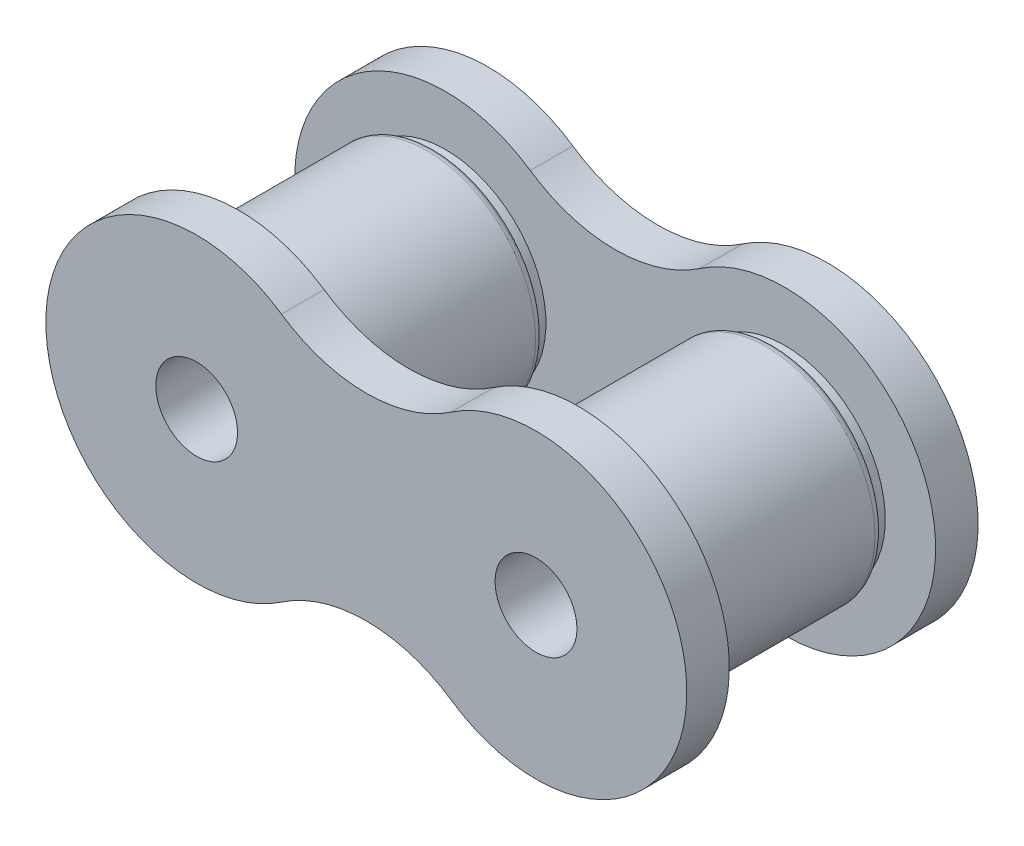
ISO-10303-21;
HEADER;
FILE_DESCRIPTION(('STEP AP214'),'2;1');
FILE_NAME('part.step','',(''),(''),'','','');
FILE_SCHEMA(('AUTOMOTIVE_DESIGN { 1 0 10303 214 1 1 1 1 }'));
ENDSEC;
DATA;
#1=APPLICATION_CONTEXT('core data for automotive mechanical design processes');
#2=APPLICATION_PROTOCOL_DEFINITION('international standard','automotive_design',2000,#1);
#3=PRODUCT_CONTEXT('',#1,'mechanical');
#4=PRODUCT('Part','Part','',(#3));
#5=PRODUCT_RELATED_PRODUCT_CATEGORY('part','',(#4));
#6=PRODUCT_DEFINITION_FORMATION('','',#4);
#7=PRODUCT_DEFINITION_CONTEXT('part definition',#1,'design');
#8=PRODUCT_DEFINITION('design','',#6,#7);
#9=PRODUCT_DEFINITION_SHAPE('','',#8);
#10=(LENGTH_UNIT() NAMED_UNIT(*) SI_UNIT(.MILLI.,.METRE.));
#11=(NAMED_UNIT(*) PLANE_ANGLE_UNIT() SI_UNIT($,.RADIAN.));
#12=(NAMED_UNIT(*) SI_UNIT($,.STERADIAN.) SOLID_ANGLE_UNIT());
#13=UNCERTAINTY_MEASURE_WITH_UNIT(LENGTH_MEASURE(1.E-05),#10,'distance_accuracy_value','');
#14=(GEOMETRIC_REPRESENTATION_CONTEXT(3) GLOBAL_UNCERTAINTY_ASSIGNED_CONTEXT((#13)) GLOBAL_UNIT_ASSIGNED_CONTEXT((#10,
#11,#12)) REPRESENTATION_CONTEXT('',''));
#15=CARTESIAN_POINT('',(0.,0.,0.));
#16=DIRECTION('',(0.,0.,1.));
#17=DIRECTION('',(1.,0.,0.));
#18=AXIS2_PLACEMENT_3D('',#15,#16,#17);
#19=CARTESIAN_POINT('',(0.,0.,-6.815));
#20=DIRECTION('',(0.,0.,-1.));
#21=DIRECTION('',(-1.,0.,0.));
#22=AXIS2_PLACEMENT_3D('',#19,#20,#21);
#23=PLANE('',#22);
#24=CARTESIAN_POINT('',(15.875,0.,-6.815));
#25=DIRECTION('',(0.,0.,-1.));
#26=DIRECTION('',(-1.,0.,0.));
#27=AXIS2_PLACEMENT_3D('',#24,#25,#26);
#28=CIRCLE('',#27,1.915);
#29=CARTESIAN_POINT('',(13.96,0.,-6.815));
#30=VERTEX_POINT('',#29);
#31=EDGE_CURVE('E315',#30,#30,#28,.T.);
#32=ORIENTED_EDGE('',*,*,#31,.F.);
#33=EDGE_LOOP('',(#32));
#34=FACE_BOUND('',#33,.T.);
#35=CARTESIAN_POINT('',(7.9375,-11.666893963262,-6.815));
#36=DIRECTION('',(0.,0.,1.));
#37=DIRECTION('',(1.,0.,0.));
#38=AXIS2_PLACEMENT_3D('',#35,#36,#37);
#39=CIRCLE('',#38,7.0555);
#40=CARTESIAN_POINT('',(11.90625,-5.833446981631,-6.815));
#41=VERTEX_POINT('',#40);
#42=CARTESIAN_POINT('',(3.96875,-5.83344698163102,-6.815));
#43=VERTEX_POINT('',#42);
#44=EDGE_CURVE('E288',#41,#43,#39,.T.);
#45=ORIENTED_EDGE('',*,*,#44,.T.);
#46=CARTESIAN_POINT('',(0.,0.,-6.815));
#47=DIRECTION('',(0.,0.,1.));
#48=DIRECTION('',(1.,0.,0.));
#49=AXIS2_PLACEMENT_3D('',#46,#47,#48);
#50=CIRCLE('',#49,7.0555);
#51=CARTESIAN_POINT('',(3.96874999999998,5.83344698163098,-6.815));
#52=VERTEX_POINT('',#51);
#53=EDGE_CURVE('E43',#43,#52,#50,.F.);
#54=ORIENTED_EDGE('',*,*,#53,.T.);
#55=CARTESIAN_POINT('',(7.9375,11.666893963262,-6.815));
#56=DIRECTION('',(0.,0.,1.));
#57=DIRECTION('',(1.,0.,0.));
#58=AXIS2_PLACEMENT_3D('',#55,#56,#57);
#59=CIRCLE('',#58,7.05550000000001);
#60=CARTESIAN_POINT('',(11.90625,5.83344698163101,-6.815));
#61=VERTEX_POINT('',#60);
#62=EDGE_CURVE('E51',#52,#61,#59,.T.);
#63=ORIENTED_EDGE('',*,*,#62,.T.);
#64=CARTESIAN_POINT('',(15.875,0.,-6.815));
#65=DIRECTION('',(0.,0.,1.));
#66=DIRECTION('',(1.,0.,0.));
#67=AXIS2_PLACEMENT_3D('',#64,#65,#66);
#68=CIRCLE('',#67,7.0555);
#69=EDGE_CURVE('E285',#61,#41,#68,.F.);
#70=ORIENTED_EDGE('',*,*,#69,.T.);
#71=EDGE_LOOP('',(#45,#54,#63,#70));
#72=FACE_BOUND('',#71,.T.);
#73=CARTESIAN_POINT('',(0.,0.,-6.815));
#74=DIRECTION('',(0.,0.,-1.));
#75=DIRECTION('',(-1.,0.,0.));
#76=AXIS2_PLACEMENT_3D('',#73,#74,#75);
#77=CIRCLE('',#76,1.9125);
#78=CARTESIAN_POINT('',(-1.9125,0.,-6.815));
#79=VERTEX_POINT('',#78);
#80=EDGE_CURVE('E11',#79,#79,#77,.F.);
#81=ORIENTED_EDGE('',*,*,#80,.T.);
#82=EDGE_LOOP('',(#81));
#83=FACE_BOUND('',#82,.T.);
#84=ADVANCED_FACE('F33',(#34,#72,#83),#23,.T.);
#85=CARTESIAN_POINT('',(0.,0.,3.943));
#86=DIRECTION('',(0.,0.,1.));
#87=DIRECTION('',(-1.,0.,0.));
#88=AXIS2_PLACEMENT_3D('',#85,#86,#87);
#89=TOROIDAL_SURFACE('',#88,4.7,0.4);
#90=CARTESIAN_POINT('',(0.,0.,4.343));
#91=DIRECTION('',(0.,0.,-1.));
#92=DIRECTION('',(-1.,0.,0.));
#93=AXIS2_PLACEMENT_3D('',#90,#91,#92);
#94=CIRCLE('',#93,4.7);
#95=CARTESIAN_POINT('',(-4.7,0.,4.343));
#96=VERTEX_POINT('',#95);
#97=EDGE_CURVE('E279',#96,#96,#94,.F.);
#98=ORIENTED_EDGE('',*,*,#97,.F.);
#99=EDGE_LOOP('',(#98));
#100=FACE_BOUND('',#99,.T.);
#101=CARTESIAN_POINT('',(0.,0.,3.943));
#102=DIRECTION('',(0.,0.,-1.));
#103=DIRECTION('',(-1.,0.,0.));
#104=AXIS2_PLACEMENT_3D('',#101,#102,#103);
#105=CIRCLE('',#104,5.1);
#106=CARTESIAN_POINT('',(-5.1,0.,3.943));
#107=VERTEX_POINT('',#106);
#108=EDGE_CURVE('E276',#107,#107,#105,.T.);
#109=ORIENTED_EDGE('',*,*,#108,.F.);
#110=EDGE_LOOP('',(#109));
#111=FACE_BOUND('',#110,.T.);
#112=ADVANCED_FACE('F35',(#100,#111),#89,.T.);
#113=CARTESIAN_POINT('',(15.875,0.,3.94299999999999));
#114=DIRECTION('',(0.,0.,1.));
#115=DIRECTION('',(-1.,0.,0.));
#116=AXIS2_PLACEMENT_3D('',#113,#114,#115);
#117=TOROIDAL_SURFACE('',#116,4.7,0.400000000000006);
#118=CARTESIAN_POINT('',(15.875,0.,3.943));
#119=DIRECTION('',(0.,0.,-1.));
#120=DIRECTION('',(-1.,0.,0.));
#121=AXIS2_PLACEMENT_3D('',#118,#119,#120);
#122=CIRCLE('',#121,5.1);
#123=CARTESIAN_POINT('',(10.775,0.,3.943));
#124=VERTEX_POINT('',#123);
#125=EDGE_CURVE('E272',#124,#124,#122,.T.);
#126=ORIENTED_EDGE('',*,*,#125,.F.);
#127=EDGE_LOOP('',(#126));
#128=FACE_BOUND('',#127,.T.);
#129=CARTESIAN_POINT('',(15.875,0.,4.343));
#130=DIRECTION('',(0.,0.,-1.));
#131=DIRECTION('',(-1.,0.,0.));
#132=AXIS2_PLACEMENT_3D('',#129,#130,#131);
#133=CIRCLE('',#132,4.7);
#134=CARTESIAN_POINT('',(11.175,0.,4.343));
#135=VERTEX_POINT('',#134);
#136=EDGE_CURVE('E282',#135,#135,#133,.F.);
#137=ORIENTED_EDGE('',*,*,#136,.F.);
#138=EDGE_LOOP('',(#137));
#139=FACE_BOUND('',#138,.T.);
#140=ADVANCED_FACE('F177',(#128,#139),#117,.T.);
#141=CARTESIAN_POINT('',(15.875,0.,4.584));
#142=DIRECTION('',(0.,0.,-1.));
#143=DIRECTION('',(-1.,0.,0.));
#144=AXIS2_PLACEMENT_3D('',#141,#142,#143);
#145=CYLINDRICAL_SURFACE('',#144,4.7);
#146=CARTESIAN_POINT('',(15.875,0.,4.825));
#147=DIRECTION('',(0.,0.,-1.));
#148=DIRECTION('',(-1.,0.,0.));
#149=AXIS2_PLACEMENT_3D('',#146,#147,#148);
#150=CIRCLE('',#149,4.7);
#151=CARTESIAN_POINT('',(11.175,0.,4.825));
#152=VERTEX_POINT('',#151);
#153=EDGE_CURVE('E116',#152,#152,#150,.F.);
#154=ORIENTED_EDGE('',*,*,#153,.F.);
#155=EDGE_LOOP('',(#154));
#156=FACE_BOUND('',#155,.T.);
#157=ORIENTED_EDGE('',*,*,#136,.T.);
#158=EDGE_LOOP('',(#157));
#159=FACE_BOUND('',#158,.T.);
#160=ADVANCED_FACE('F174',(#156,#159),#145,.T.);
#161=CARTESIAN_POINT('',(0.,0.,4.584));
#162=DIRECTION('',(0.,0.,-1.));
#163=DIRECTION('',(-1.,0.,0.));
#164=AXIS2_PLACEMENT_3D('',#161,#162,#163);
#165=CYLINDRICAL_SURFACE('',#164,4.7);
#166=CARTESIAN_POINT('',(0.,0.,4.825));
#167=DIRECTION('',(0.,0.,-1.));
#168=DIRECTION('',(-1.,0.,0.));
#169=AXIS2_PLACEMENT_3D('',#166,#167,#168);
#170=CIRCLE('',#169,4.7);
#171=CARTESIAN_POINT('',(-4.7,0.,4.825));
#172=VERTEX_POINT('',#171);
#173=EDGE_CURVE('E275',#172,#172,#170,.F.);
#174=ORIENTED_EDGE('',*,*,#173,.F.);
#175=EDGE_LOOP('',(#174));
#176=FACE_BOUND('',#175,.T.);
#177=ORIENTED_EDGE('',*,*,#97,.T.);
#178=EDGE_LOOP('',(#177));
#179=FACE_BOUND('',#178,.T.);
#180=ADVANCED_FACE('F170',(#176,#179),#165,.T.);
#181=CARTESIAN_POINT('',(0.,0.,0.));
#182=DIRECTION('',(0.,0.,-1.));
#183=DIRECTION('',(-1.,0.,0.));
#184=AXIS2_PLACEMENT_3D('',#181,#182,#183);
#185=CYLINDRICAL_SURFACE('',#184,5.1);
#186=CARTESIAN_POINT('',(0.,0.,-3.943));
#187=DIRECTION('',(0.,0.,1.));
#188=DIRECTION('',(-1.,0.,0.));
#189=AXIS2_PLACEMENT_3D('',#186,#187,#188);
#190=CIRCLE('',#189,5.1);
#191=CARTESIAN_POINT('',(-5.1,0.,-3.943));
#192=VERTEX_POINT('',#191);
#193=EDGE_CURVE('E269',#192,#192,#190,.F.);
#194=ORIENTED_EDGE('',*,*,#193,.F.);
#195=EDGE_LOOP('',(#194));
#196=FACE_BOUND('',#195,.T.);
#197=ORIENTED_EDGE('',*,*,#108,.T.);
#198=EDGE_LOOP('',(#197));
#199=FACE_BOUND('',#198,.T.);
#200=ADVANCED_FACE('F166',(#196,#199),#185,.T.);
#201=CARTESIAN_POINT('',(15.875,0.,0.));
#202=DIRECTION('',(0.,0.,-1.));
#203=DIRECTION('',(-1.,0.,0.));
#204=AXIS2_PLACEMENT_3D('',#201,#202,#203);
#205=CYLINDRICAL_SURFACE('',#204,5.1);
#206=ORIENTED_EDGE('',*,*,#125,.T.);
#207=EDGE_LOOP('',(#206));
#208=FACE_BOUND('',#207,.T.);
#209=CARTESIAN_POINT('',(15.875,0.,-3.94299999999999));
#210=DIRECTION('',(0.,0.,1.));
#211=DIRECTION('',(-1.,0.,0.));
#212=AXIS2_PLACEMENT_3D('',#209,#210,#211);
#213=CIRCLE('',#212,5.10000000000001);
#214=CARTESIAN_POINT('',(10.775,0.,-3.94299999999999));
#215=VERTEX_POINT('',#214);
#216=EDGE_CURVE('E258',#215,#215,#213,.F.);
#217=ORIENTED_EDGE('',*,*,#216,.F.);
#218=EDGE_LOOP('',(#217));
#219=FACE_BOUND('',#218,.T.);
#220=ADVANCED_FACE('F162',(#208,#219),#205,.T.);
#221=CARTESIAN_POINT('',(0.,0.,4.825));
#222=DIRECTION('',(0.,0.,-1.));
#223=DIRECTION('',(-1.,0.,0.));
#224=AXIS2_PLACEMENT_3D('',#221,#222,#223);
#225=PLANE('',#224);
#226=ORIENTED_EDGE('',*,*,#173,.T.);
#227=EDGE_LOOP('',(#226));
#228=FACE_BOUND('',#227,.T.);
#229=CARTESIAN_POINT('',(15.875,0.,4.825));
#230=DIRECTION('',(0.,0.,-1.));
#231=DIRECTION('',(-1.,0.,0.));
#232=AXIS2_PLACEMENT_3D('',#229,#230,#231);
#233=CIRCLE('',#232,7.0555);
#234=CARTESIAN_POINT('',(11.90625,-5.833446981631,4.825));
#235=VERTEX_POINT('',#234);
#236=CARTESIAN_POINT('',(11.90625,5.83344698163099,4.825));
#237=VERTEX_POINT('',#236);
#238=EDGE_CURVE('E97',#235,#237,#233,.F.);
#239=ORIENTED_EDGE('',*,*,#238,.F.);
#240=CARTESIAN_POINT('',(7.9375,-11.666893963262,4.825));
#241=DIRECTION('',(0.,0.,-1.));
#242=DIRECTION('',(-1.,0.,0.));
#243=AXIS2_PLACEMENT_3D('',#240,#241,#242);
#244=CIRCLE('',#243,7.0555);
#245=CARTESIAN_POINT('',(3.96875,-5.833446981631,4.825));
#246=VERTEX_POINT('',#245);
#247=EDGE_CURVE('E117',#235,#246,#244,.F.);
#248=ORIENTED_EDGE('',*,*,#247,.T.);
#249=CARTESIAN_POINT('',(0.,0.,4.825));
#250=DIRECTION('',(0.,0.,-1.));
#251=DIRECTION('',(-1.,0.,0.));
#252=AXIS2_PLACEMENT_3D('',#249,#250,#251);
#253=CIRCLE('',#252,7.0555);
#254=CARTESIAN_POINT('',(3.96875,5.833446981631,4.825));
#255=VERTEX_POINT('',#254);
#256=EDGE_CURVE('E112',#255,#246,#253,.F.);
#257=ORIENTED_EDGE('',*,*,#256,.F.);
#258=CARTESIAN_POINT('',(7.9375,11.666893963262,4.825));
#259=DIRECTION('',(0.,0.,-1.));
#260=DIRECTION('',(-1.,0.,0.));
#261=AXIS2_PLACEMENT_3D('',#258,#259,#260);
#262=CIRCLE('',#261,7.05550000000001);
#263=EDGE_CURVE('E109',#255,#237,#262,.F.);
#264=ORIENTED_EDGE('',*,*,#263,.T.);
#265=EDGE_LOOP('',(#239,#248,#257,#264));
#266=FACE_BOUND('',#265,.T.);
#267=ORIENTED_EDGE('',*,*,#153,.T.);
#268=EDGE_LOOP('',(#267));
#269=FACE_BOUND('',#268,.T.);
#270=ADVANCED_FACE('F110',(#228,#266,#269),#225,.T.);
#271=CARTESIAN_POINT('',(0.,0.,-3.943));
#272=DIRECTION('',(0.,0.,1.));
#273=DIRECTION('',(-1.,0.,0.));
#274=AXIS2_PLACEMENT_3D('',#271,#272,#273);
#275=TOROIDAL_SURFACE('',#274,4.7,0.4);
#276=ORIENTED_EDGE('',*,*,#193,.T.);
#277=EDGE_LOOP('',(#276));
#278=FACE_BOUND('',#277,.T.);
#279=CARTESIAN_POINT('',(0.,0.,-4.343));
#280=DIRECTION('',(0.,0.,-1.));
#281=DIRECTION('',(-1.,0.,0.));
#282=AXIS2_PLACEMENT_3D('',#279,#280,#281);
#283=CIRCLE('',#282,4.7);
#284=CARTESIAN_POINT('',(-4.7,0.,-4.343));
#285=VERTEX_POINT('',#284);
#286=EDGE_CURVE('E263',#285,#285,#283,.T.);
#287=ORIENTED_EDGE('',*,*,#286,.F.);
#288=EDGE_LOOP('',(#287));
#289=FACE_BOUND('',#288,.T.);
#290=ADVANCED_FACE('F154',(#278,#289),#275,.T.);
#291=CARTESIAN_POINT('',(15.875,0.,-3.94299999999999));
#292=DIRECTION('',(0.,0.,1.));
#293=DIRECTION('',(-1.,0.,0.));
#294=AXIS2_PLACEMENT_3D('',#291,#292,#293);
#295=TOROIDAL_SURFACE('',#294,4.7,0.400000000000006);
#296=CARTESIAN_POINT('',(15.875,0.,-4.343));
#297=DIRECTION('',(0.,0.,-1.));
#298=DIRECTION('',(-1.,0.,0.));
#299=AXIS2_PLACEMENT_3D('',#296,#297,#298);
#300=CIRCLE('',#299,4.7);
#301=CARTESIAN_POINT('',(11.175,0.,-4.343));
#302=VERTEX_POINT('',#301);
#303=EDGE_CURVE('E259',#302,#302,#300,.T.);
#304=ORIENTED_EDGE('',*,*,#303,.F.);
#305=EDGE_LOOP('',(#304));
#306=FACE_BOUND('',#305,.T.);
#307=ORIENTED_EDGE('',*,*,#216,.T.);
#308=EDGE_LOOP('',(#307));
#309=FACE_BOUND('',#308,.T.);
#310=ADVANCED_FACE('F150',(#306,#309),#295,.T.);
#311=CARTESIAN_POINT('',(15.875,0.,4.825));
#312=DIRECTION('',(0.,0.,-1.));
#313=DIRECTION('',(-1.,0.,0.));
#314=AXIS2_PLACEMENT_3D('',#311,#312,#313);
#315=CYLINDRICAL_SURFACE('',#314,7.0555);
#316=DIRECTION('',(0.,0.,-1.));
#317=VECTOR('',#316,1.);
#318=CARTESIAN_POINT('',(11.90625,-5.833446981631,4.825));
#319=LINE('',#318,#317);
#320=CARTESIAN_POINT('',(11.90625,-5.833446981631,6.815));
#321=VERTEX_POINT('',#320);
#322=EDGE_CURVE('E103',#321,#235,#319,.T.);
#323=ORIENTED_EDGE('',*,*,#322,.T.);
#324=ORIENTED_EDGE('',*,*,#238,.T.);
#325=DIRECTION('',(0.,0.,-1.));
#326=VECTOR('',#325,1.);
#327=CARTESIAN_POINT('',(11.90625,5.83344698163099,4.825));
#328=LINE('',#327,#326);
#329=CARTESIAN_POINT('',(11.90625,5.83344698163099,6.815));
#330=VERTEX_POINT('',#329);
#331=EDGE_CURVE('E101',#237,#330,#328,.F.);
#332=ORIENTED_EDGE('',*,*,#331,.T.);
#333=CARTESIAN_POINT('',(15.875,0.,6.815));
#334=DIRECTION('',(0.,0.,-1.));
#335=DIRECTION('',(-1.,0.,0.));
#336=AXIS2_PLACEMENT_3D('',#333,#334,#335);
#337=CIRCLE('',#336,7.0555);
#338=EDGE_CURVE('E123',#330,#321,#337,.T.);
#339=ORIENTED_EDGE('',*,*,#338,.T.);
#340=EDGE_LOOP('',(#323,#324,#332,#339));
#341=FACE_BOUND('',#340,.T.);
#342=ADVANCED_FACE('F99',(#341),#315,.T.);
#343=CARTESIAN_POINT('',(7.9375,-11.666893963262,4.825));
#344=DIRECTION('',(0.,0.,-1.));
#345=DIRECTION('',(-1.,0.,0.));
#346=AXIS2_PLACEMENT_3D('',#343,#344,#345);
#347=CYLINDRICAL_SURFACE('',#346,7.0555);
#348=DIRECTION('',(0.,0.,-1.));
#349=VECTOR('',#348,1.);
#350=CARTESIAN_POINT('',(3.96875,-5.83344698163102,4.825));
#351=LINE('',#350,#349);
#352=CARTESIAN_POINT('',(3.96875,-5.833446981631,6.815));
#353=VERTEX_POINT('',#352);
#354=EDGE_CURVE('E250',#246,#353,#351,.F.);
#355=ORIENTED_EDGE('',*,*,#354,.F.);
#356=ORIENTED_EDGE('',*,*,#247,.F.);
#357=ORIENTED_EDGE('',*,*,#322,.F.);
#358=CARTESIAN_POINT('',(7.9375,-11.666893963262,6.815));
#359=DIRECTION('',(0.,0.,-1.));
#360=DIRECTION('',(-1.,0.,0.));
#361=AXIS2_PLACEMENT_3D('',#358,#359,#360);
#362=CIRCLE('',#361,7.0555);
#363=EDGE_CURVE('E125',#321,#353,#362,.F.);
#364=ORIENTED_EDGE('',*,*,#363,.T.);
#365=EDGE_LOOP('',(#355,#356,#357,#364));
#366=FACE_BOUND('',#365,.T.);
#367=ADVANCED_FACE('F241',(#366),#347,.F.);
#368=CARTESIAN_POINT('',(0.,0.,4.825));
#369=DIRECTION('',(0.,0.,-1.));
#370=DIRECTION('',(-1.,0.,0.));
#371=AXIS2_PLACEMENT_3D('',#368,#369,#370);
#372=CYLINDRICAL_SURFACE('',#371,7.0555);
#373=DIRECTION('',(0.,0.,-1.));
#374=VECTOR('',#373,1.);
#375=CARTESIAN_POINT('',(3.96874999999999,5.83344698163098,4.825));
#376=LINE('',#375,#374);
#377=CARTESIAN_POINT('',(3.96875,5.833446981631,6.815));
#378=VERTEX_POINT('',#377);
#379=EDGE_CURVE('E129',#378,#255,#376,.T.);
#380=ORIENTED_EDGE('',*,*,#379,.T.);
#381=ORIENTED_EDGE('',*,*,#256,.T.);
#382=ORIENTED_EDGE('',*,*,#354,.T.);
#383=CARTESIAN_POINT('',(0.,0.,6.815));
#384=DIRECTION('',(0.,0.,-1.));
#385=DIRECTION('',(-1.,0.,0.));
#386=AXIS2_PLACEMENT_3D('',#383,#384,#385);
#387=CIRCLE('',#386,7.0555);
#388=EDGE_CURVE('E253',#353,#378,#387,.T.);
#389=ORIENTED_EDGE('',*,*,#388,.T.);
#390=EDGE_LOOP('',(#380,#381,#382,#389));
#391=FACE_BOUND('',#390,.T.);
#392=ADVANCED_FACE('F239',(#391),#372,.T.);
#393=CARTESIAN_POINT('',(7.9375,11.666893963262,4.825));
#394=DIRECTION('',(0.,0.,-1.));
#395=DIRECTION('',(-1.,0.,0.));
#396=AXIS2_PLACEMENT_3D('',#393,#394,#395);
#397=CYLINDRICAL_SURFACE('',#396,7.05550000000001);
#398=ORIENTED_EDGE('',*,*,#331,.F.);
#399=ORIENTED_EDGE('',*,*,#263,.F.);
#400=ORIENTED_EDGE('',*,*,#379,.F.);
#401=CARTESIAN_POINT('',(7.9375,11.666893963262,6.815));
#402=DIRECTION('',(0.,0.,-1.));
#403=DIRECTION('',(-1.,0.,0.));
#404=AXIS2_PLACEMENT_3D('',#401,#402,#403);
#405=CIRCLE('',#404,7.05550000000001);
#406=EDGE_CURVE('E121',#378,#330,#405,.F.);
#407=ORIENTED_EDGE('',*,*,#406,.T.);
#408=EDGE_LOOP('',(#398,#399,#400,#407));
#409=FACE_BOUND('',#408,.T.);
#410=ADVANCED_FACE('F119',(#409),#397,.F.);
#411=CARTESIAN_POINT('',(0.,0.,-4.584));
#412=DIRECTION('',(0.,0.,-1.));
#413=DIRECTION('',(-1.,0.,0.));
#414=AXIS2_PLACEMENT_3D('',#411,#412,#413);
#415=CYLINDRICAL_SURFACE('',#414,4.7);
#416=CARTESIAN_POINT('',(0.,0.,-4.825));
#417=DIRECTION('',(0.,0.,-1.));
#418=DIRECTION('',(-1.,0.,0.));
#419=AXIS2_PLACEMENT_3D('',#416,#417,#418);
#420=CIRCLE('',#419,4.7);
#421=CARTESIAN_POINT('',(-4.7,0.,-4.825));
#422=VERTEX_POINT('',#421);
#423=EDGE_CURVE('E266',#422,#422,#420,.F.);
#424=ORIENTED_EDGE('',*,*,#423,.T.);
#425=EDGE_LOOP('',(#424));
#426=FACE_BOUND('',#425,.T.);
#427=ORIENTED_EDGE('',*,*,#286,.T.);
#428=EDGE_LOOP('',(#427));
#429=FACE_BOUND('',#428,.T.);
#430=ADVANCED_FACE('F232',(#426,#429),#415,.T.);
#431=CARTESIAN_POINT('',(15.875,0.,-4.584));
#432=DIRECTION('',(0.,0.,-1.));
#433=DIRECTION('',(-1.,0.,0.));
#434=AXIS2_PLACEMENT_3D('',#431,#432,#433);
#435=CYLINDRICAL_SURFACE('',#434,4.7);
#436=ORIENTED_EDGE('',*,*,#303,.T.);
#437=EDGE_LOOP('',(#436));
#438=FACE_BOUND('',#437,.T.);
#439=CARTESIAN_POINT('',(15.875,0.,-4.825));
#440=DIRECTION('',(0.,0.,-1.));
#441=DIRECTION('',(-1.,0.,0.));
#442=AXIS2_PLACEMENT_3D('',#439,#440,#441);
#443=CIRCLE('',#442,4.7);
#444=CARTESIAN_POINT('',(11.175,0.,-4.825));
#445=VERTEX_POINT('',#444);
#446=EDGE_CURVE('E262',#445,#445,#443,.F.);
#447=ORIENTED_EDGE('',*,*,#446,.T.);
#448=EDGE_LOOP('',(#447));
#449=FACE_BOUND('',#448,.T.);
#450=ADVANCED_FACE('F228',(#438,#449),#435,.T.);
#451=CARTESIAN_POINT('',(0.,0.,6.815));
#452=DIRECTION('',(0.,0.,-1.));
#453=DIRECTION('',(-1.,0.,0.));
#454=AXIS2_PLACEMENT_3D('',#451,#452,#453);
#455=PLANE('',#454);
#456=CARTESIAN_POINT('',(15.875,0.,6.815));
#457=DIRECTION('',(0.,0.,-1.));
#458=DIRECTION('',(-1.,0.,0.));
#459=AXIS2_PLACEMENT_3D('',#456,#457,#458);
#460=CIRCLE('',#459,1.915);
#461=CARTESIAN_POINT('',(13.96,0.,6.815));
#462=VERTEX_POINT('',#461);
#463=EDGE_CURVE('E290',#462,#462,#460,.T.);
#464=ORIENTED_EDGE('',*,*,#463,.T.);
#465=EDGE_LOOP('',(#464));
#466=FACE_BOUND('',#465,.T.);
#467=ORIENTED_EDGE('',*,*,#388,.F.);
#468=ORIENTED_EDGE('',*,*,#363,.F.);
#469=ORIENTED_EDGE('',*,*,#338,.F.);
#470=ORIENTED_EDGE('',*,*,#406,.F.);
#471=EDGE_LOOP('',(#467,#468,#469,#470));
#472=FACE_BOUND('',#471,.T.);
#473=CARTESIAN_POINT('',(0.,0.,6.815));
#474=DIRECTION('',(0.,0.,-1.));
#475=DIRECTION('',(-1.,0.,0.));
#476=AXIS2_PLACEMENT_3D('',#473,#474,#475);
#477=CIRCLE('',#476,1.9125);
#478=CARTESIAN_POINT('',(-1.9125,0.,6.815));
#479=VERTEX_POINT('',#478);
#480=EDGE_CURVE('E299',#479,#479,#477,.T.);
#481=ORIENTED_EDGE('',*,*,#480,.T.);
#482=EDGE_LOOP('',(#481));
#483=FACE_BOUND('',#482,.T.);
#484=ADVANCED_FACE('F224',(#466,#472,#483),#455,.F.);
#485=CARTESIAN_POINT('',(0.,0.,-4.825));
#486=DIRECTION('',(0.,0.,-1.));
#487=DIRECTION('',(-1.,0.,0.));
#488=AXIS2_PLACEMENT_3D('',#485,#486,#487);
#489=PLANE('',#488);
#490=ORIENTED_EDGE('',*,*,#446,.F.);
#491=EDGE_LOOP('',(#490));
#492=FACE_BOUND('',#491,.T.);
#493=CARTESIAN_POINT('',(7.9375,-11.666893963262,-4.825));
#494=DIRECTION('',(0.,0.,1.));
#495=DIRECTION('',(1.,0.,0.));
#496=AXIS2_PLACEMENT_3D('',#493,#494,#495);
#497=CIRCLE('',#496,7.0555);
#498=CARTESIAN_POINT('',(3.96875,-5.833446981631,-4.825));
#499=VERTEX_POINT('',#498);
#500=CARTESIAN_POINT('',(11.90625,-5.833446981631,-4.825));
#501=VERTEX_POINT('',#500);
#502=EDGE_CURVE('E295',#499,#501,#497,.F.);
#503=ORIENTED_EDGE('',*,*,#502,.T.);
#504=CARTESIAN_POINT('',(15.875,0.,-4.825));
#505=DIRECTION('',(0.,0.,1.));
#506=DIRECTION('',(1.,0.,0.));
#507=AXIS2_PLACEMENT_3D('',#504,#505,#506);
#508=CIRCLE('',#507,7.0555);
#509=CARTESIAN_POINT('',(11.90625,5.833446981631,-4.825));
#510=VERTEX_POINT('',#509);
#511=EDGE_CURVE('E142',#510,#501,#508,.F.);
#512=ORIENTED_EDGE('',*,*,#511,.F.);
#513=CARTESIAN_POINT('',(7.9375,11.666893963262,-4.825));
#514=DIRECTION('',(0.,0.,1.));
#515=DIRECTION('',(1.,0.,0.));
#516=AXIS2_PLACEMENT_3D('',#513,#514,#515);
#517=CIRCLE('',#516,7.05550000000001);
#518=CARTESIAN_POINT('',(3.96874999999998,5.83344698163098,-4.825));
#519=VERTEX_POINT('',#518);
#520=EDGE_CURVE('E138',#510,#519,#517,.F.);
#521=ORIENTED_EDGE('',*,*,#520,.T.);
#522=CARTESIAN_POINT('',(0.,0.,-4.825));
#523=DIRECTION('',(0.,0.,1.));
#524=DIRECTION('',(1.,0.,0.));
#525=AXIS2_PLACEMENT_3D('',#522,#523,#524);
#526=CIRCLE('',#525,7.0555);
#527=EDGE_CURVE('E134',#499,#519,#526,.F.);
#528=ORIENTED_EDGE('',*,*,#527,.F.);
#529=EDGE_LOOP('',(#503,#512,#521,#528));
#530=FACE_BOUND('',#529,.T.);
#531=ORIENTED_EDGE('',*,*,#423,.F.);
#532=EDGE_LOOP('',(#531));
#533=FACE_BOUND('',#532,.T.);
#534=ADVANCED_FACE('F220',(#492,#530,#533),#489,.F.);
#535=CARTESIAN_POINT('',(0.,0.,0.));
#536=DIRECTION('',(0.,0.,-1.));
#537=DIRECTION('',(-1.,0.,0.));
#538=AXIS2_PLACEMENT_3D('',#535,#536,#537);
#539=CYLINDRICAL_SURFACE('',#538,1.9125);
#540=ORIENTED_EDGE('',*,*,#480,.F.);
#541=EDGE_LOOP('',(#540));
#542=FACE_BOUND('',#541,.T.);
#543=ORIENTED_EDGE('',*,*,#80,.F.);
#544=EDGE_LOOP('',(#543));
#545=FACE_BOUND('',#544,.T.);
#546=ADVANCED_FACE('F216',(#542,#545),#539,.F.);
#547=CARTESIAN_POINT('',(7.9375,-11.666893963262,-4.825));
#548=DIRECTION('',(0.,0.,1.));
#549=DIRECTION('',(1.,0.,0.));
#550=AXIS2_PLACEMENT_3D('',#547,#548,#549);
#551=CYLINDRICAL_SURFACE('',#550,7.0555);
#552=DIRECTION('',(0.,0.,1.));
#553=VECTOR('',#552,1.);
#554=CARTESIAN_POINT('',(11.90625,-5.83344698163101,-4.825));
#555=LINE('',#554,#553);
#556=EDGE_CURVE('E143',#501,#41,#555,.F.);
#557=ORIENTED_EDGE('',*,*,#556,.F.);
#558=ORIENTED_EDGE('',*,*,#502,.F.);
#559=DIRECTION('',(0.,0.,1.));
#560=VECTOR('',#559,1.);
#561=CARTESIAN_POINT('',(3.96875,-5.83344698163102,-4.825));
#562=LINE('',#561,#560);
#563=EDGE_CURVE('E131',#43,#499,#562,.T.);
#564=ORIENTED_EDGE('',*,*,#563,.F.);
#565=ORIENTED_EDGE('',*,*,#44,.F.);
#566=EDGE_LOOP('',(#557,#558,#564,#565));
#567=FACE_BOUND('',#566,.T.);
#568=ADVANCED_FACE('F212',(#567),#551,.F.);
#569=CARTESIAN_POINT('',(0.,0.,-4.825));
#570=DIRECTION('',(0.,0.,1.));
#571=DIRECTION('',(1.,0.,0.));
#572=AXIS2_PLACEMENT_3D('',#569,#570,#571);
#573=CYLINDRICAL_SURFACE('',#572,7.0555);
#574=DIRECTION('',(0.,0.,1.));
#575=VECTOR('',#574,1.);
#576=CARTESIAN_POINT('',(3.96874999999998,5.83344698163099,-4.825));
#577=LINE('',#576,#575);
#578=EDGE_CURVE('E135',#519,#52,#577,.F.);
#579=ORIENTED_EDGE('',*,*,#578,.T.);
#580=ORIENTED_EDGE('',*,*,#53,.F.);
#581=ORIENTED_EDGE('',*,*,#563,.T.);
#582=ORIENTED_EDGE('',*,*,#527,.T.);
#583=EDGE_LOOP('',(#579,#580,#581,#582));
#584=FACE_BOUND('',#583,.T.);
#585=ADVANCED_FACE('F207',(#584),#573,.T.);
#586=CARTESIAN_POINT('',(7.9375,11.666893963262,-4.825));
#587=DIRECTION('',(0.,0.,1.));
#588=DIRECTION('',(1.,0.,0.));
#589=AXIS2_PLACEMENT_3D('',#586,#587,#588);
#590=CYLINDRICAL_SURFACE('',#589,7.05550000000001);
#591=ORIENTED_EDGE('',*,*,#578,.F.);
#592=ORIENTED_EDGE('',*,*,#520,.F.);
#593=DIRECTION('',(0.,0.,1.));
#594=VECTOR('',#593,1.);
#595=CARTESIAN_POINT('',(11.90625,5.83344698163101,-4.825));
#596=LINE('',#595,#594);
#597=EDGE_CURVE('E139',#61,#510,#596,.T.);
#598=ORIENTED_EDGE('',*,*,#597,.F.);
#599=ORIENTED_EDGE('',*,*,#62,.F.);
#600=EDGE_LOOP('',(#591,#592,#598,#599));
#601=FACE_BOUND('',#600,.T.);
#602=ADVANCED_FACE('F200',(#601),#590,.F.);
#603=CARTESIAN_POINT('',(15.875,0.,-4.825));
#604=DIRECTION('',(0.,0.,1.));
#605=DIRECTION('',(1.,0.,0.));
#606=AXIS2_PLACEMENT_3D('',#603,#604,#605);
#607=CYLINDRICAL_SURFACE('',#606,7.0555);
#608=ORIENTED_EDGE('',*,*,#556,.T.);
#609=ORIENTED_EDGE('',*,*,#69,.F.);
#610=ORIENTED_EDGE('',*,*,#597,.T.);
#611=ORIENTED_EDGE('',*,*,#511,.T.);
#612=EDGE_LOOP('',(#608,#609,#610,#611));
#613=FACE_BOUND('',#612,.T.);
#614=ADVANCED_FACE('F192',(#613),#607,.T.);
#615=CARTESIAN_POINT('',(15.875,0.,6.815));
#616=DIRECTION('',(0.,0.,-1.));
#617=DIRECTION('',(-1.,0.,0.));
#618=AXIS2_PLACEMENT_3D('',#615,#616,#617);
#619=CYLINDRICAL_SURFACE('',#618,1.915);
#620=CARTESIAN_POINT('',(13.96,0.,6.815));
#621=CARTESIAN_POINT('',(13.96,0.,6.67302083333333));
#622=CARTESIAN_POINT('',(13.96,0.,6.53104166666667));
#623=CARTESIAN_POINT('',(13.96,0.,6.24708333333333));
#624=CARTESIAN_POINT('',(13.96,0.,6.10510416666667));
#625=CARTESIAN_POINT('',(13.96,0.,5.82114583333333));
#626=CARTESIAN_POINT('',(13.96,0.,5.67916666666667));
#627=CARTESIAN_POINT('',(13.96,0.,5.39520833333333));
#628=CARTESIAN_POINT('',(13.96,0.,5.25322916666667));
#629=CARTESIAN_POINT('',(13.96,0.,4.96927083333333));
#630=CARTESIAN_POINT('',(13.96,0.,4.82729166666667));
#631=CARTESIAN_POINT('',(13.96,0.,4.54333333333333));
#632=CARTESIAN_POINT('',(13.96,0.,4.40135416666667));
#633=CARTESIAN_POINT('',(13.96,0.,4.11739583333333));
#634=CARTESIAN_POINT('',(13.96,0.,3.97541666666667));
#635=CARTESIAN_POINT('',(13.96,0.,3.69145833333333));
#636=CARTESIAN_POINT('',(13.96,0.,3.54947916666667));
#637=CARTESIAN_POINT('',(13.96,0.,3.26552083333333));
#638=CARTESIAN_POINT('',(13.96,0.,3.12354166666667));
#639=CARTESIAN_POINT('',(13.96,0.,2.83958333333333));
#640=CARTESIAN_POINT('',(13.96,0.,2.69760416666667));
#641=CARTESIAN_POINT('',(13.96,0.,2.41364583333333));
#642=CARTESIAN_POINT('',(13.96,0.,2.27166666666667));
#643=CARTESIAN_POINT('',(13.96,0.,1.98770833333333));
#644=CARTESIAN_POINT('',(13.96,0.,1.84572916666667));
#645=CARTESIAN_POINT('',(13.96,0.,1.56177083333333));
#646=CARTESIAN_POINT('',(13.96,0.,1.41979166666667));
#647=CARTESIAN_POINT('',(13.96,0.,1.13583333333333));
#648=CARTESIAN_POINT('',(13.96,0.,0.993854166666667));
#649=CARTESIAN_POINT('',(13.96,0.,0.709895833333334));
#650=CARTESIAN_POINT('',(13.96,0.,0.567916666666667));
#651=CARTESIAN_POINT('',(13.96,0.,0.283958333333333));
#652=CARTESIAN_POINT('',(13.96,0.,0.141979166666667));
#653=CARTESIAN_POINT('',(13.96,0.,-0.141979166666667));
#654=CARTESIAN_POINT('',(13.96,0.,-0.283958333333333));
#655=CARTESIAN_POINT('',(13.96,0.,-0.567916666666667));
#656=CARTESIAN_POINT('',(13.96,0.,-0.709895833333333));
#657=CARTESIAN_POINT('',(13.96,0.,-0.993854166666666));
#658=CARTESIAN_POINT('',(13.96,0.,-1.13583333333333));
#659=CARTESIAN_POINT('',(13.96,0.,-1.41979166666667));
#660=CARTESIAN_POINT('',(13.96,0.,-1.56177083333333));
#661=CARTESIAN_POINT('',(13.96,0.,-1.84572916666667));
#662=CARTESIAN_POINT('',(13.96,0.,-1.98770833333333));
#663=CARTESIAN_POINT('',(13.96,0.,-2.27166666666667));
#664=CARTESIAN_POINT('',(13.96,0.,-2.41364583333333));
#665=CARTESIAN_POINT('',(13.96,0.,-2.69760416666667));
#666=CARTESIAN_POINT('',(13.96,0.,-2.83958333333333));
#667=CARTESIAN_POINT('',(13.96,0.,-3.12354166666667));
#668=CARTESIAN_POINT('',(13.96,0.,-3.26552083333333));
#669=CARTESIAN_POINT('',(13.96,0.,-3.54947916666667));
#670=CARTESIAN_POINT('',(13.96,0.,-3.69145833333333));
#671=CARTESIAN_POINT('',(13.96,0.,-3.97541666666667));
#672=CARTESIAN_POINT('',(13.96,0.,-4.11739583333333));
#673=CARTESIAN_POINT('',(13.96,0.,-4.40135416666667));
#674=CARTESIAN_POINT('',(13.96,0.,-4.54333333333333));
#675=CARTESIAN_POINT('',(13.96,0.,-4.82729166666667));
#676=CARTESIAN_POINT('',(13.96,0.,-4.96927083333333));
#677=CARTESIAN_POINT('',(13.96,0.,-5.25322916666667));
#678=CARTESIAN_POINT('',(13.96,0.,-5.39520833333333));
#679=CARTESIAN_POINT('',(13.96,0.,-5.67916666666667));
#680=CARTESIAN_POINT('',(13.96,0.,-5.82114583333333));
#681=CARTESIAN_POINT('',(13.96,0.,-6.10510416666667));
#682=CARTESIAN_POINT('',(13.96,0.,-6.24708333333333));
#683=CARTESIAN_POINT('',(13.96,0.,-6.53104166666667));
#684=CARTESIAN_POINT('',(13.96,0.,-6.67302083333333));
#685=CARTESIAN_POINT('',(13.96,0.,-6.815));
#686=B_SPLINE_CURVE_WITH_KNOTS('',3,(#620,#621,#622,#623,#624,#625,#626,#627,#628,#629,#630,
#631,#632,#633,#634,#635,#636,#637,#638,#639,#640,#641,#642,#643,#644,#645,#646,#647,#648,#649,
#650,#651,#652,#653,#654,#655,#656,#657,#658,#659,#660,#661,#662,#663,#664,#665,#666,#667,#668,
#669,#670,#671,#672,#673,#674,#675,#676,#677,#678,#679,#680,#681,#682,#683,#684,#685),
.UNSPECIFIED.,.F.,.F.,(4,2,2,2,2,2,2,2,2,2,2,2,2,2,2,2,2,2,2,2,2,2,2,2,2,2,2,2,2,2,2,2,4),(0.,
0.425937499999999,0.851874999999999,1.2778125,1.70375,2.1296875,2.555625,2.9815625,3.4075,
3.8334375,4.259375,4.6853125,5.11125,5.5371875,5.963125,6.3890625,6.815,7.2409375,7.666875,
8.0928125,8.51875,8.9446875,9.370625,9.7965625,10.2225,10.6484375,11.074375,11.5003125,11.92625,
12.3521875,12.778125,13.2040625,13.63),.UNSPECIFIED.);
#687=EDGE_CURVE('BSEAM186',#462,#30,#686,.T.);
#688=ORIENTED_EDGE('',*,*,#463,.F.);
#689=ORIENTED_EDGE('',*,*,#31,.T.);
#690=ORIENTED_EDGE('',*,*,#687,.T.);
#691=ORIENTED_EDGE('',*,*,#687,.F.);
#692=EDGE_LOOP('',(#688,#690,#689,#691));
#693=FACE_BOUND('',#692,.T.);
#694=ADVANCED_FACE('F186',(#693),#619,.F.);
#695=CLOSED_SHELL('',(#84,#112,#140,#160,#180,#200,#220,#270,#290,#310,#342,#367,#392,#410,#430,
#450,#484,#534,#546,#568,#585,#602,#614,#694));
#696=MANIFOLD_SOLID_BREP('B2',#695);
#697=ADVANCED_BREP_SHAPE_REPRESENTATION('',(#18,#696),#14);
#698=SHAPE_DEFINITION_REPRESENTATION(#9,#697);
ENDSEC;
END-ISO-10303-21;
